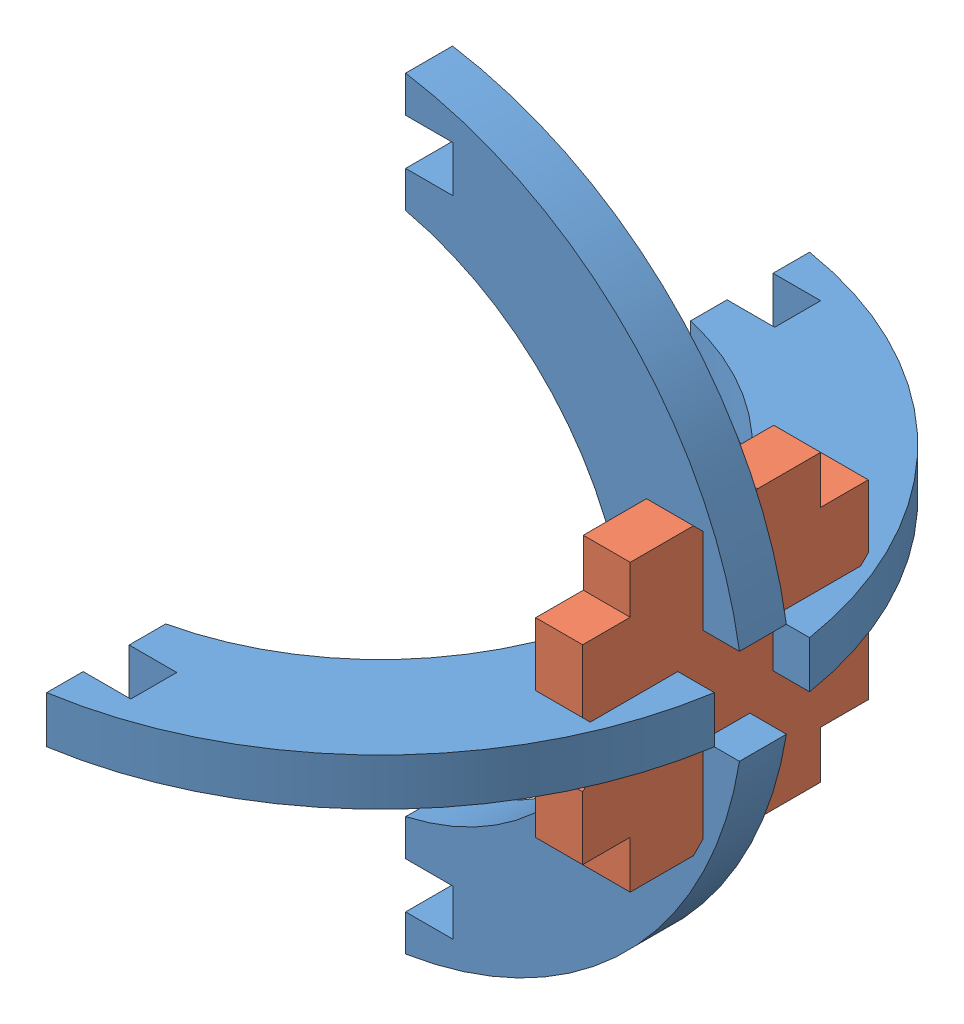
SolidWorks assembly half_dome.SLDASM, configuration Default (file format 4700). Lengths in mm.
Overall size (44.53 101.76 101.76).
5 component instances, 2 part files, 12 mates.
Components (placement in the parent):
- slot_2-1: slot_2.SLDPRT [Default] at (-30.949 10.2199 14.3089) size (44.53 6.26 44.53)
- slot_2-3: slot_2.SLDPRT [Default] at (-30.949 6.8734 23.6624) x (1 0 0) z (0 1 0) size (44.53 6.26 44.53)
- slot_2-4: slot_2.SLDPRT [Default] at (-30.949 19.5734 17.4013) x (1 0 0) z (0 -1 0) size (44.53 6.26 44.53)
- slot_2-5: slot_2.SLDPRT [Default] at (-30.949 16.481 27.0089) x (1 0 0) z (0 0 -1) size (44.53 6.26 44.53)
- connector-1: connector.SLDPRT [Default] at (-11.9145 13.2234 28.4443) x (0 -1 0) z (0 0 1) size (38.1 6.26 38.1)
Mates (geometry in assembly coordinates):
- Coincident25: coincident anti-aligned: plane of slot_2-3 through (-11.7875 0.5234 17.4013) normal (0 1 0); plane of connector-1 through (-5.6534 0.5234 23.6624) normal (0 -1 0)
- Coincident26: coincident anti-aligned: plane of slot_2-1 through (-11.7875 16.481 7.9589) normal (0 0 1); plane of connector-1 through (-5.6534 16.227 7.9589) normal (0 0 -1)
- Coincident27: coincident anti-aligned: plane of slot_2-4 through (-5.6534 19.5734 23.6624) normal (-1 0 0); plane of connector-1 through (-5.6534 16.227 39.7089) normal (1 0 0)
- Coincident28: coincident anti-aligned: plane of slot_2-5 through (-5.6534 10.2199 27.0089) normal (-1 0 0); plane of connector-1 through (-5.6534 16.227 39.7089) normal (1 0 0)
- Coincident29: coincident anti-aligned: plane of slot_2-3 through (-5.6534 6.8734 17.4013) normal (-1 0 0); plane of connector-1 through (-5.6534 16.227 39.7089) normal (1 0 0)
- Coincident30: coincident anti-aligned: plane of slot_2-1 through (-5.6534 16.481 14.3089) normal (-1 0 0); plane of connector-1 through (-5.6534 16.227 39.7089) normal (1 0 0)
- Coincident31: coincident anti-aligned: plane of slot_2-1 through (-53.8001 10.2199 22.798) normal (0 -1 0); plane of connector-1 through (-5.6534 10.2199 1.6089) normal (0 1 0)
- Coincident32: coincident anti-aligned: plane of slot_2-4 through (-11.7875 25.9234 23.6624) normal (0 -1 0); plane of connector-1 through (-5.6534 25.9234 23.6624) normal (0 1 0)
- Coincident33: coincident anti-aligned: plane of slot_2-4 through (-53.8001 11.0843 23.6624) normal (0 0 1); plane of connector-1 through (-5.6534 25.9234 23.6624) normal (0 0 -1)
- Coincident34: coincident anti-aligned: plane of slot_2-3 through (-53.8001 15.3626 23.6624) normal (0 0 1); plane of connector-1 through (-5.6534 0.5234 23.6624) normal (0 0 -1)
- Coincident35: coincident: line of slot_2-5 through (-11.7875 10.2199 33.3589) axis (1 0 0); plane of connector-1 through (-5.6534 16.227 33.3589) normal (0 0 1)
- Coincident36: coincident anti-aligned: plane of slot_2-5 through (-53.8001 10.2199 18.5197) normal (0 -1 0); plane of connector-1 through (-5.6534 10.2199 39.7089) normal (0 1 0)
